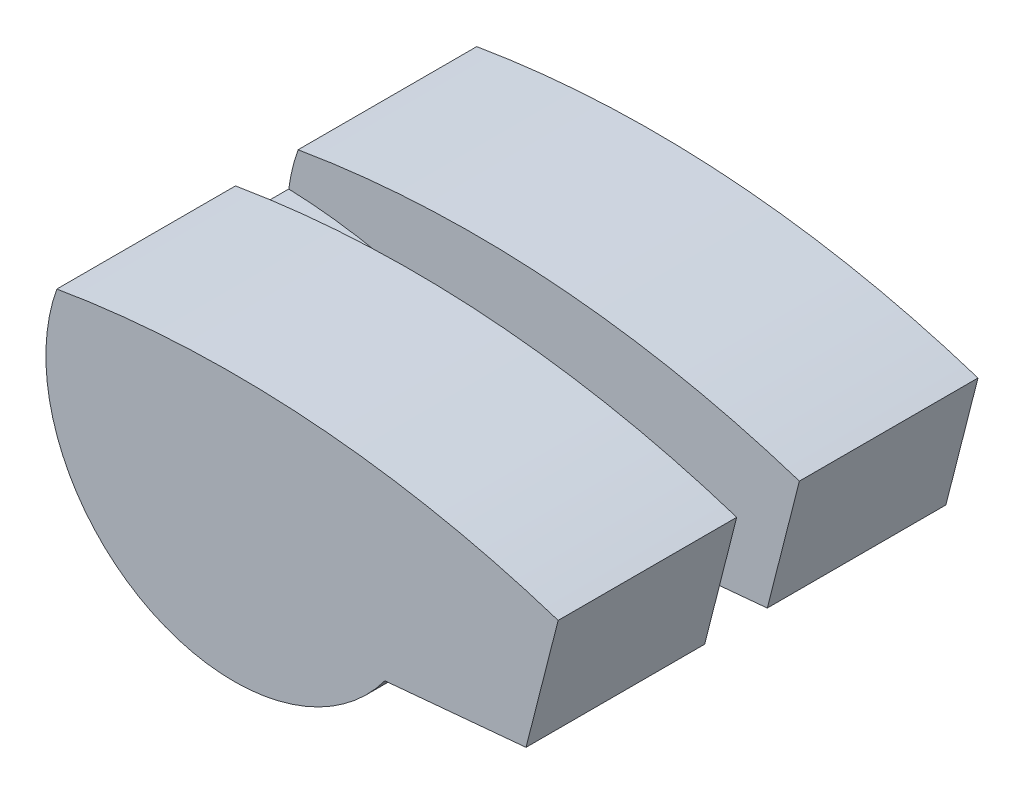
from build123d import *

# Parameters (mm, degrees)
EXTRUSION1_DEPTH        = 3.35
ENL_V_START             = -0.5
ENL_V_MAT_EXTRU_1_DEPTH = 1


with BuildPart() as part:
    # Esquisse1 → Extrusion1 (new, symmetric)
    with BuildSketch(Plane.XY):
        with BuildLine():
            Line((2.409373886, -1.787433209), (4.662460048, -1.581075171))
            Line((4.662460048, -1.581075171), (5.175157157, 0.430481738))
            ThreePointArc((5.175157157, 0.430481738), (1.210362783, 1.206212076), (-2.824842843, 1.010080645))
            ThreePointArc((-2.824842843, 1.010080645), (-1.414098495, -2.645812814), (2.409373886, -1.787433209))
        make_face()
    extrude(amount=EXTRUSION1_DEPTH, both=True)

    # Esquisse2 → Enl_v. mat.-Extru.1 (cut)
    with BuildSketch(Plane.XY.offset(ENL_V_START)):
        with BuildLine():
            Line((2.409373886, -1.787433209), (2.693020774, -1.761454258))
            ThreePointArc((2.693020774, -1.761454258), (3.654671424, -1.985438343), (4.598143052, -2.276646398))
            Line((4.598143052, -2.276646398), (5.762730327, -1.015530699))
            Line((5.762730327, -1.015530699), (5.976327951, 0.147555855))
            ThreePointArc((5.976327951, 0.147555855), (1.263748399, 1.202258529), (-3.553875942, 0.86864276))
            Line((-3.553875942, 0.86864276), (-3.553875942, 0.27817097))
            ThreePointArc((-3.553875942, 0.27817097), (-3.275126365, 0.338379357), (-2.99535854, 0.393663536))
            ThreePointArc((-2.99535854, 0.393663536), (-0.099548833, -0.217534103), (2.409373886, -1.787433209))
        make_face()
    extrude(amount=ENL_V_MAT_EXTRU_1_DEPTH, mode=Mode.SUBTRACT)


solid = part.part
